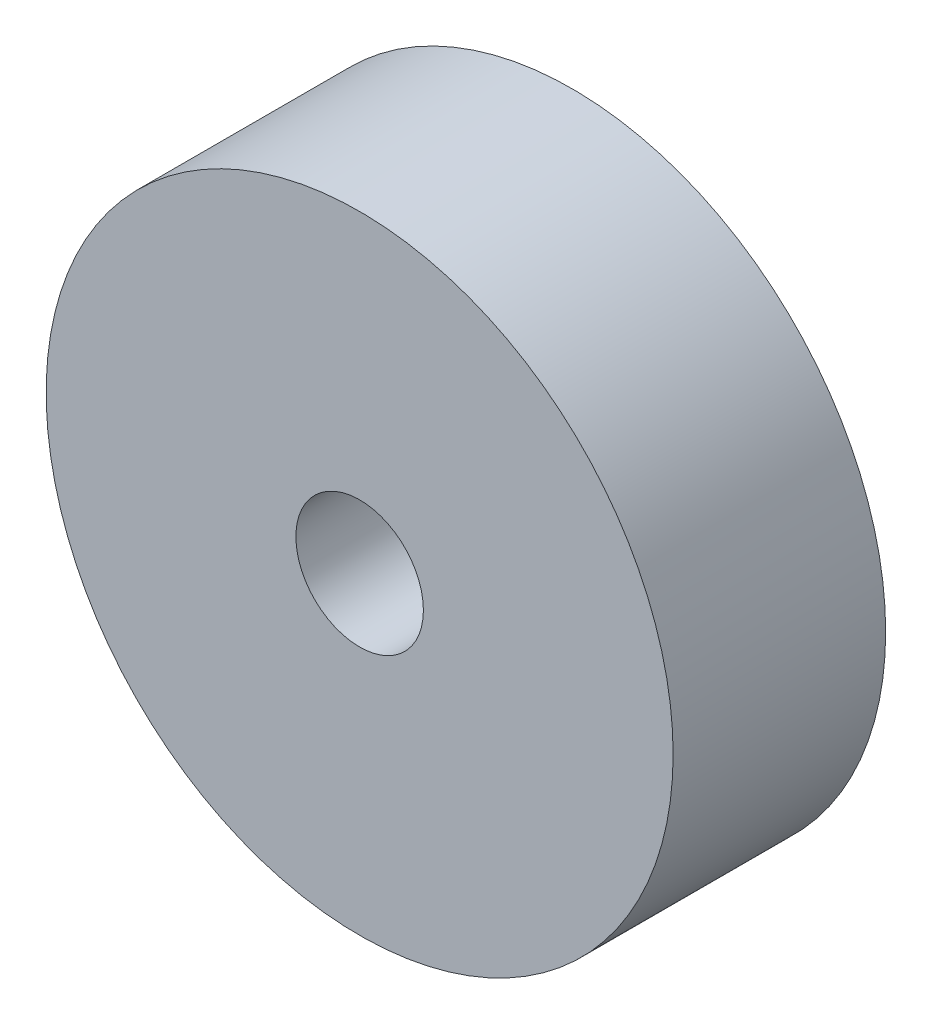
from build123d import *

# Parameters (mm, degrees)
ESQUISSE1_R        = 14.75
ESQUISSE1_R_2      = 3
BOSS_EXTRU_1_DEPTH = 10


with BuildPart() as part:
    # Esquisse1 → Boss.-Extru.1 (new body)
    with BuildSketch(Plane.XY):
        Circle(ESQUISSE1_R)
        Circle(ESQUISSE1_R_2, mode=Mode.SUBTRACT)
    extrude(amount=BOSS_EXTRU_1_DEPTH)


solid = part.part
